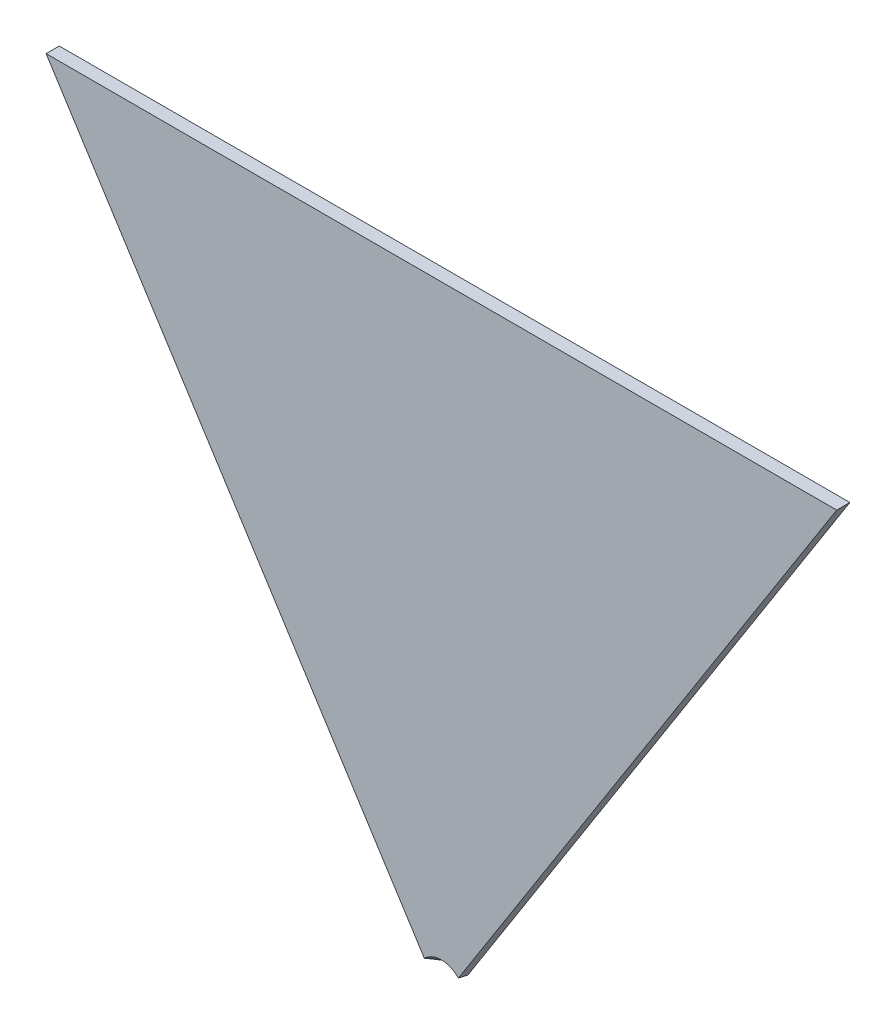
ISO-10303-21;
HEADER;
FILE_DESCRIPTION(('STEP AP214'),'2;1');
FILE_NAME('part.step','',(''),(''),'','','');
FILE_SCHEMA(('AUTOMOTIVE_DESIGN { 1 0 10303 214 1 1 1 1 }'));
ENDSEC;
DATA;
#1=APPLICATION_CONTEXT('core data for automotive mechanical design processes');
#2=APPLICATION_PROTOCOL_DEFINITION('international standard','automotive_design',2000,#1);
#3=PRODUCT_CONTEXT('',#1,'mechanical');
#4=PRODUCT('Part','Part','',(#3));
#5=PRODUCT_RELATED_PRODUCT_CATEGORY('part','',(#4));
#6=PRODUCT_DEFINITION_FORMATION('','',#4);
#7=PRODUCT_DEFINITION_CONTEXT('part definition',#1,'design');
#8=PRODUCT_DEFINITION('design','',#6,#7);
#9=PRODUCT_DEFINITION_SHAPE('','',#8);
#10=(LENGTH_UNIT() NAMED_UNIT(*) SI_UNIT(.MILLI.,.METRE.));
#11=(NAMED_UNIT(*) PLANE_ANGLE_UNIT() SI_UNIT($,.RADIAN.));
#12=(NAMED_UNIT(*) SI_UNIT($,.STERADIAN.) SOLID_ANGLE_UNIT());
#13=UNCERTAINTY_MEASURE_WITH_UNIT(LENGTH_MEASURE(1.E-05),#10,'distance_accuracy_value','');
#14=(GEOMETRIC_REPRESENTATION_CONTEXT(3) GLOBAL_UNCERTAINTY_ASSIGNED_CONTEXT((#13)) GLOBAL_UNIT_ASSIGNED_CONTEXT((#10,
#11,#12)) REPRESENTATION_CONTEXT('',''));
#15=CARTESIAN_POINT('',(0.,0.,0.));
#16=DIRECTION('',(0.,0.,1.));
#17=DIRECTION('',(1.,0.,0.));
#18=AXIS2_PLACEMENT_3D('',#15,#16,#17);
#19=CARTESIAN_POINT('',(-284.066242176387,9.70603070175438,15.));
#20=DIRECTION('',(0.,-1.,0.));
#21=DIRECTION('',(0.,0.,-1.));
#22=AXIS2_PLACEMENT_3D('',#19,#20,#21);
#23=PLANE('',#22);
#24=DIRECTION('',(-1.,0.,0.));
#25=VECTOR('',#24,1.);
#26=CARTESIAN_POINT('',(-284.066242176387,9.70603070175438,0.));
#27=LINE('',#26,#25);
#28=CARTESIAN_POINT('',(615.933757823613,9.70603070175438,0.));
#29=VERTEX_POINT('',#28);
#30=CARTESIAN_POINT('',(-284.066242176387,9.70603070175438,0.));
#31=VERTEX_POINT('',#30);
#32=EDGE_CURVE('E96',#29,#31,#27,.T.);
#33=ORIENTED_EDGE('',*,*,#32,.T.);
#34=DIRECTION('',(0.,0.,-1.));
#35=VECTOR('',#34,1.);
#36=CARTESIAN_POINT('',(-284.066242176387,9.70603070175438,15.));
#37=LINE('',#36,#35);
#38=CARTESIAN_POINT('',(-284.066242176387,9.70603070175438,15.));
#39=VERTEX_POINT('',#38);
#40=EDGE_CURVE('E47',#39,#31,#37,.T.);
#41=ORIENTED_EDGE('',*,*,#40,.F.);
#42=DIRECTION('',(-1.,0.,0.));
#43=VECTOR('',#42,1.);
#44=CARTESIAN_POINT('',(-284.066242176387,9.70603070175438,15.));
#45=LINE('',#44,#43);
#46=CARTESIAN_POINT('',(615.933757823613,9.70603070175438,15.));
#47=VERTEX_POINT('',#46);
#48=EDGE_CURVE('E90',#47,#39,#45,.T.);
#49=ORIENTED_EDGE('',*,*,#48,.F.);
#50=DIRECTION('',(0.,0.,-1.));
#51=VECTOR('',#50,1.);
#52=CARTESIAN_POINT('',(615.933757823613,9.70603070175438,15.));
#53=LINE('',#52,#51);
#54=EDGE_CURVE('E82',#47,#29,#53,.T.);
#55=ORIENTED_EDGE('',*,*,#54,.T.);
#56=EDGE_LOOP('',(#33,#41,#49,#55));
#57=FACE_BOUND('',#56,.T.);
#58=ADVANCED_FACE('F39',(#57),#23,.F.);
#59=CARTESIAN_POINT('',(-284.066242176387,9.70603070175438,15.));
#60=DIRECTION('',(0.843632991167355,0.536920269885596,0.));
#61=DIRECTION('',(-0.536920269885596,0.843632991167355,0.));
#62=AXIS2_PLACEMENT_3D('',#59,#60,#61);
#63=PLANE('',#62);
#64=DIRECTION('',(0.536920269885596,-0.843632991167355,0.));
#65=VECTOR('',#64,1.);
#66=CARTESIAN_POINT('',(-284.066242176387,9.70603070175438,0.));
#67=LINE('',#66,#65);
#68=CARTESIAN_POINT('',(151.043414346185,-673.957599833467,0.));
#69=VERTEX_POINT('',#68);
#70=EDGE_CURVE('E91',#31,#69,#67,.T.);
#71=ORIENTED_EDGE('',*,*,#70,.T.);
#72=CARTESIAN_POINT('',(165.933757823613,-697.353969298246,14.9999999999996));
#73=DIRECTION('',(0.843632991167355,0.536920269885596,0.));
#74=DIRECTION('',(-0.276684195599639,0.434738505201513,0.856999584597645));
#75=AXIS2_PLACEMENT_3D('',#72,#73,#74);
#76=ELLIPSE('',#75,101.079692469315,31.5);
#77=CARTESIAN_POINT('',(146.536263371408,-666.875763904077,15.));
#78=VERTEX_POINT('',#77);
#79=EDGE_CURVE('E57',#69,#78,#76,.T.);
#80=ORIENTED_EDGE('',*,*,#79,.T.);
#81=DIRECTION('',(0.536920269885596,-0.843632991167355,0.));
#82=VECTOR('',#81,1.);
#83=CARTESIAN_POINT('',(-284.066242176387,9.70603070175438,15.));
#84=LINE('',#83,#82);
#85=EDGE_CURVE('E114',#39,#78,#84,.T.);
#86=ORIENTED_EDGE('',*,*,#85,.F.);
#87=ORIENTED_EDGE('',*,*,#40,.T.);
#88=EDGE_LOOP('',(#71,#80,#86,#87));
#89=FACE_BOUND('',#88,.T.);
#90=ADVANCED_FACE('F112',(#89),#63,.F.);
#91=CARTESIAN_POINT('',(165.933757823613,-697.353969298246,15.));
#92=DIRECTION('',(-0.843632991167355,0.536920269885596,0.));
#93=DIRECTION('',(-0.536920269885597,-0.843632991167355,0.));
#94=AXIS2_PLACEMENT_3D('',#91,#92,#93);
#95=PLANE('',#94);
#96=DIRECTION('',(0.536920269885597,0.843632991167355,0.));
#97=VECTOR('',#96,1.);
#98=CARTESIAN_POINT('',(165.933757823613,-697.353969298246,15.));
#99=LINE('',#98,#97);
#100=CARTESIAN_POINT('',(185.331252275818,-666.875763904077,15.));
#101=VERTEX_POINT('',#100);
#102=EDGE_CURVE('E65',#101,#47,#99,.T.);
#103=ORIENTED_EDGE('',*,*,#102,.F.);
#104=CARTESIAN_POINT('',(165.933757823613,-697.353969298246,14.9999999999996));
#105=DIRECTION('',(-0.843632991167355,0.536920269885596,0.));
#106=DIRECTION('',(0.276684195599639,0.434738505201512,0.856999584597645));
#107=AXIS2_PLACEMENT_3D('',#104,#105,#106);
#108=ELLIPSE('',#107,101.079692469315,31.5);
#109=CARTESIAN_POINT('',(180.824101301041,-673.957599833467,0.));
#110=VERTEX_POINT('',#109);
#111=EDGE_CURVE('E86',#101,#110,#108,.T.);
#112=ORIENTED_EDGE('',*,*,#111,.T.);
#113=DIRECTION('',(0.536920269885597,0.843632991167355,0.));
#114=VECTOR('',#113,1.);
#115=CARTESIAN_POINT('',(165.933757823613,-697.353969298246,0.));
#116=LINE('',#115,#114);
#117=EDGE_CURVE('E79',#110,#29,#116,.T.);
#118=ORIENTED_EDGE('',*,*,#117,.T.);
#119=ORIENTED_EDGE('',*,*,#54,.F.);
#120=EDGE_LOOP('',(#103,#112,#118,#119));
#121=FACE_BOUND('',#120,.T.);
#122=ADVANCED_FACE('F81',(#121),#95,.F.);
#123=CARTESIAN_POINT('',(0.,0.,15.));
#124=DIRECTION('',(0.,0.,1.));
#125=DIRECTION('',(1.,0.,0.));
#126=AXIS2_PLACEMENT_3D('',#123,#124,#125);
#127=PLANE('',#126);
#128=CARTESIAN_POINT('',(165.933757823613,-697.353969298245,15.));
#129=DIRECTION('',(0.,0.,1.));
#130=DIRECTION('',(0.,1.,0.));
#131=AXIS2_PLACEMENT_3D('',#128,#129,#130);
#132=ELLIPSE('',#131,38.6824611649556,31.5);
#133=EDGE_CURVE('E102',#101,#78,#132,.T.);
#134=ORIENTED_EDGE('',*,*,#133,.F.);
#135=ORIENTED_EDGE('',*,*,#102,.T.);
#136=ORIENTED_EDGE('',*,*,#48,.T.);
#137=ORIENTED_EDGE('',*,*,#85,.T.);
#138=EDGE_LOOP('',(#134,#135,#136,#137));
#139=FACE_BOUND('',#138,.T.);
#140=ADVANCED_FACE('F116',(#139),#127,.T.);
#141=CARTESIAN_POINT('',(0.,0.,0.));
#142=DIRECTION('',(0.,0.,1.));
#143=DIRECTION('',(1.,0.,0.));
#144=AXIS2_PLACEMENT_3D('',#141,#142,#143);
#145=PLANE('',#144);
#146=ORIENTED_EDGE('',*,*,#117,.F.);
#147=CARTESIAN_POINT('',(165.933757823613,-708.045297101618,0.));
#148=DIRECTION('',(0.,0.,1.));
#149=DIRECTION('',(0.,1.,0.));
#150=AXIS2_PLACEMENT_3D('',#147,#148,#149);
#151=ELLIPSE('',#150,38.6824611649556,31.5);
#152=EDGE_CURVE('E11',#110,#69,#151,.T.);
#153=ORIENTED_EDGE('',*,*,#152,.T.);
#154=ORIENTED_EDGE('',*,*,#70,.F.);
#155=ORIENTED_EDGE('',*,*,#32,.F.);
#156=EDGE_LOOP('',(#146,#153,#154,#155));
#157=FACE_BOUND('',#156,.T.);
#158=ADVANCED_FACE('F98',(#157),#145,.F.);
#159=CARTESIAN_POINT('',(165.933757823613,-704.443615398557,5.05318203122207));
#160=DIRECTION('',(0.,0.580412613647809,0.814322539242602));
#161=DIRECTION('',(0.,-0.814322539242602,0.580412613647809));
#162=AXIS2_PLACEMENT_3D('',#159,#160,#161);
#163=CYLINDRICAL_SURFACE('',#162,31.5);
#164=ORIENTED_EDGE('',*,*,#133,.T.);
#165=ORIENTED_EDGE('',*,*,#79,.F.);
#166=ORIENTED_EDGE('',*,*,#152,.F.);
#167=ORIENTED_EDGE('',*,*,#111,.F.);
#168=EDGE_LOOP('',(#164,#165,#166,#167));
#169=FACE_BOUND('',#168,.T.);
#170=ADVANCED_FACE('F129',(#169),#163,.F.);
#171=CLOSED_SHELL('',(#58,#90,#122,#140,#158,#170));
#172=MANIFOLD_SOLID_BREP('B2',#171);
#173=ADVANCED_BREP_SHAPE_REPRESENTATION('',(#18,#172),#14);
#174=SHAPE_DEFINITION_REPRESENTATION(#9,#173);
ENDSEC;
END-ISO-10303-21;
